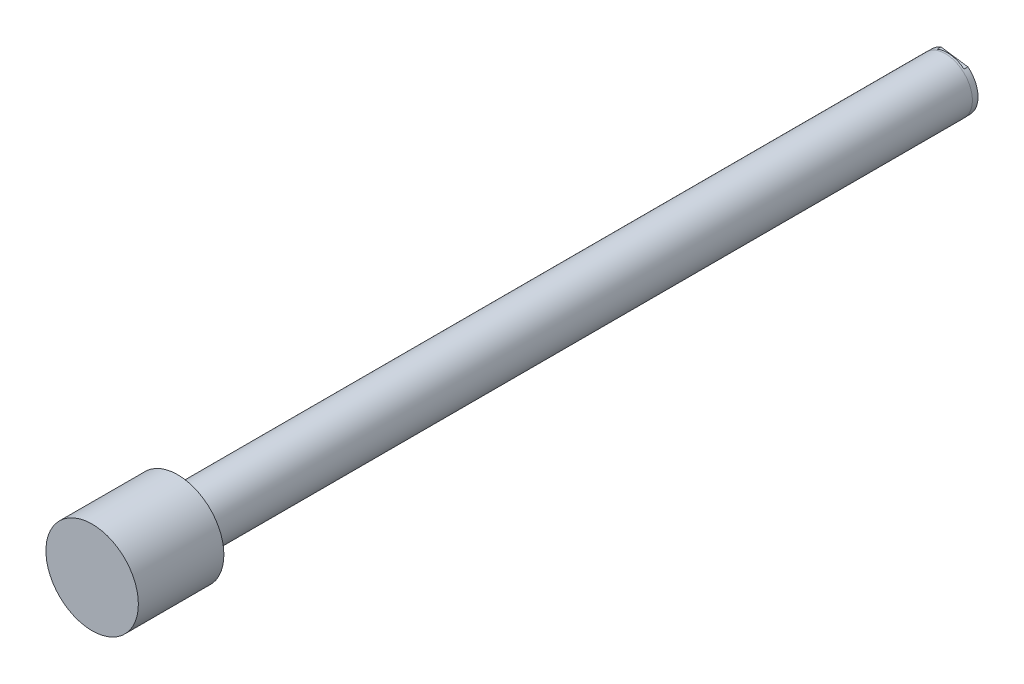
ISO-10303-21;
HEADER;
FILE_DESCRIPTION(('STEP AP214'),'2;1');
FILE_NAME('part.step','',(''),(''),'','','');
FILE_SCHEMA(('AUTOMOTIVE_DESIGN { 1 0 10303 214 1 1 1 1 }'));
ENDSEC;
DATA;
#1=APPLICATION_CONTEXT('core data for automotive mechanical design processes');
#2=APPLICATION_PROTOCOL_DEFINITION('international standard','automotive_design',2000,#1);
#3=PRODUCT_CONTEXT('',#1,'mechanical');
#4=PRODUCT('Part','Part','',(#3));
#5=PRODUCT_RELATED_PRODUCT_CATEGORY('part','',(#4));
#6=PRODUCT_DEFINITION_FORMATION('','',#4);
#7=PRODUCT_DEFINITION_CONTEXT('part definition',#1,'design');
#8=PRODUCT_DEFINITION('design','',#6,#7);
#9=PRODUCT_DEFINITION_SHAPE('','',#8);
#10=(LENGTH_UNIT() NAMED_UNIT(*) SI_UNIT(.MILLI.,.METRE.));
#11=(NAMED_UNIT(*) PLANE_ANGLE_UNIT() SI_UNIT($,.RADIAN.));
#12=(NAMED_UNIT(*) SI_UNIT($,.STERADIAN.) SOLID_ANGLE_UNIT());
#13=UNCERTAINTY_MEASURE_WITH_UNIT(LENGTH_MEASURE(1.E-05),#10,'distance_accuracy_value','');
#14=(GEOMETRIC_REPRESENTATION_CONTEXT(3) GLOBAL_UNCERTAINTY_ASSIGNED_CONTEXT((#13)) GLOBAL_UNIT_ASSIGNED_CONTEXT((#10,
#11,#12)) REPRESENTATION_CONTEXT('',''));
#15=CARTESIAN_POINT('',(0.,0.,0.));
#16=DIRECTION('',(0.,0.,1.));
#17=DIRECTION('',(1.,0.,0.));
#18=AXIS2_PLACEMENT_3D('',#15,#16,#17);
#19=CARTESIAN_POINT('',(0.,0.,-629.6581));
#20=DIRECTION('',(0.,0.,-1.));
#21=DIRECTION('',(-0.99026806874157,0.139173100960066,0.));
#22=AXIS2_PLACEMENT_3D('',#19,#20,#21);
#23=CONICAL_SURFACE('',#22,8.73125,1.02974425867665);
#24=CARTESIAN_POINT('',(0.,0.,-624.411835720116));
#25=VERTEX_POINT('',#24);
#26=VERTEX_LOOP('',#25);
#27=FACE_BOUND('',#26,.T.);
#28=CARTESIAN_POINT('',(0.,0.,-629.6581));
#29=DIRECTION('',(0.,0.,-1.));
#30=DIRECTION('',(-0.99026806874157,0.139173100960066,0.));
#31=AXIS2_PLACEMENT_3D('',#28,#29,#30);
#32=CIRCLE('',#31,8.73125);
#33=CARTESIAN_POINT('',(-8.64627807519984,1.21515513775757,-629.6581));
#34=VERTEX_POINT('',#33);
#35=EDGE_CURVE('E93',#34,#34,#32,.T.);
#36=ORIENTED_EDGE('',*,*,#35,.T.);
#37=EDGE_LOOP('',(#36));
#38=FACE_BOUND('',#37,.T.);
#39=ADVANCED_FACE('F16',(#27,#38),#23,.F.);
#40=CARTESIAN_POINT('',(0.,0.,-672.5206));
#41=DIRECTION('',(0.,0.,-1.));
#42=DIRECTION('',(-0.99026806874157,0.139173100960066,0.));
#43=AXIS2_PLACEMENT_3D('',#40,#41,#42);
#44=CYLINDRICAL_SURFACE('',#43,8.73125);
#45=ORIENTED_EDGE('',*,*,#35,.F.);
#46=EDGE_LOOP('',(#45));
#47=FACE_BOUND('',#46,.T.);
#48=CARTESIAN_POINT('',(0.,0.,-672.5206));
#49=DIRECTION('',(0.,0.,-1.));
#50=DIRECTION('',(-0.99026806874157,0.139173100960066,0.));
#51=AXIS2_PLACEMENT_3D('',#48,#49,#50);
#52=CIRCLE('',#51,8.73125);
#53=CARTESIAN_POINT('',(-8.64627807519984,1.21515513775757,-672.5206));
#54=VERTEX_POINT('',#53);
#55=EDGE_CURVE('E97',#54,#54,#52,.T.);
#56=ORIENTED_EDGE('',*,*,#55,.T.);
#57=EDGE_LOOP('',(#56));
#58=FACE_BOUND('',#57,.T.);
#59=ADVANCED_FACE('F128',(#47,#58),#44,.F.);
#60=CARTESIAN_POINT('',(0.,0.,-669.3456));
#61=DIRECTION('',(0.,0.,-1.));
#62=DIRECTION('',(-0.99026806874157,0.139173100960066,0.));
#63=AXIS2_PLACEMENT_3D('',#60,#61,#62);
#64=PLANE('',#63);
#65=CARTESIAN_POINT('',(0.,0.,-669.3456));
#66=DIRECTION('',(0.,0.,-1.));
#67=DIRECTION('',(-0.99026806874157,0.139173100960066,0.));
#68=AXIS2_PLACEMENT_3D('',#65,#66,#67);
#69=CIRCLE('',#68,22.098);
#70=CARTESIAN_POINT('',(8.43883097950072,-20.4232156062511,-669.3456));
#71=VERTEX_POINT('',#70);
#72=CARTESIAN_POINT('',(-13.7413261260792,-17.3059978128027,-669.3456));
#73=VERTEX_POINT('',#72);
#74=EDGE_CURVE('E65',#71,#73,#69,.T.);
#75=ORIENTED_EDGE('',*,*,#74,.T.);
#76=DIRECTION('',(0.99026806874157,-0.139173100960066,0.));
#77=VECTOR('',#76,1.);
#78=CARTESIAN_POINT('',(8.43883097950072,-20.4232156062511,-669.3456));
#79=LINE('',#78,#77);
#80=EDGE_CURVE('E67',#73,#71,#79,.T.);
#81=ORIENTED_EDGE('',*,*,#80,.T.);
#82=EDGE_LOOP('',(#75,#81));
#83=FACE_BOUND('',#82,.T.);
#84=ADVANCED_FACE('F66',(#83),#64,.T.);
#85=CARTESIAN_POINT('',(0.,0.,-669.3456));
#86=DIRECTION('',(0.,0.,-1.));
#87=DIRECTION('',(-0.99026806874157,0.139173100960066,0.));
#88=AXIS2_PLACEMENT_3D('',#85,#86,#87);
#89=PLANE('',#88);
#90=CARTESIAN_POINT('',(0.,0.,-669.3456));
#91=DIRECTION('',(0.,0.,-1.));
#92=DIRECTION('',(-0.99026806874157,0.139173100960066,0.));
#93=AXIS2_PLACEMENT_3D('',#90,#91,#92);
#94=CIRCLE('',#93,22.098);
#95=CARTESIAN_POINT('',(-8.43883097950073,20.4232156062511,-669.3456));
#96=VERTEX_POINT('',#95);
#97=CARTESIAN_POINT('',(13.7413261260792,17.3059978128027,-669.3456));
#98=VERTEX_POINT('',#97);
#99=EDGE_CURVE('E85',#96,#98,#94,.T.);
#100=ORIENTED_EDGE('',*,*,#99,.T.);
#101=DIRECTION('',(-0.99026806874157,0.139173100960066,0.));
#102=VECTOR('',#101,1.);
#103=CARTESIAN_POINT('',(13.7413261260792,17.3059978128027,-669.3456));
#104=LINE('',#103,#102);
#105=EDGE_CURVE('E87',#98,#96,#104,.T.);
#106=ORIENTED_EDGE('',*,*,#105,.T.);
#107=EDGE_LOOP('',(#100,#106));
#108=FACE_BOUND('',#107,.T.);
#109=ADVANCED_FACE('F118',(#108),#89,.T.);
#110=CARTESIAN_POINT('',(13.7413261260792,17.3059978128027,-669.3456));
#111=DIRECTION('',(-0.139173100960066,-0.99026806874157,0.));
#112=DIRECTION('',(0.,0.,-1.));
#113=AXIS2_PLACEMENT_3D('',#110,#111,#112);
#114=PLANE('',#113);
#115=DIRECTION('',(-0.99026806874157,0.139173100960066,0.));
#116=VECTOR('',#115,1.);
#117=CARTESIAN_POINT('',(13.7413261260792,17.3059978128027,-672.5206));
#118=LINE('',#117,#116);
#119=CARTESIAN_POINT('',(13.7413261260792,17.3059978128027,-672.5206));
#120=VERTEX_POINT('',#119);
#121=CARTESIAN_POINT('',(-8.43883097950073,20.4232156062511,-672.5206));
#122=VERTEX_POINT('',#121);
#123=EDGE_CURVE('E81',#120,#122,#118,.T.);
#124=ORIENTED_EDGE('',*,*,#123,.T.);
#125=DIRECTION('',(0.,0.,-1.));
#126=VECTOR('',#125,1.);
#127=CARTESIAN_POINT('',(-8.43883097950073,20.4232156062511,-669.3456));
#128=LINE('',#127,#126);
#129=EDGE_CURVE('E91',#96,#122,#128,.T.);
#130=ORIENTED_EDGE('',*,*,#129,.F.);
#131=ORIENTED_EDGE('',*,*,#105,.F.);
#132=DIRECTION('',(0.,0.,-1.));
#133=VECTOR('',#132,1.);
#134=CARTESIAN_POINT('',(13.7413261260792,17.3059978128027,-669.3456));
#135=LINE('',#134,#133);
#136=EDGE_CURVE('E41',#98,#120,#135,.T.);
#137=ORIENTED_EDGE('',*,*,#136,.T.);
#138=EDGE_LOOP('',(#124,#130,#131,#137));
#139=FACE_BOUND('',#138,.T.);
#140=ADVANCED_FACE('F115',(#139),#114,.F.);
#141=CARTESIAN_POINT('',(0.,0.,-672.5206));
#142=DIRECTION('',(0.,0.,-1.));
#143=DIRECTION('',(-0.99026806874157,0.139173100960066,0.));
#144=AXIS2_PLACEMENT_3D('',#141,#142,#143);
#145=PLANE('',#144);
#146=DIRECTION('',(0.99026806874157,-0.139173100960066,0.));
#147=VECTOR('',#146,1.);
#148=CARTESIAN_POINT('',(8.43883097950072,-20.4232156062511,-672.5206));
#149=LINE('',#148,#147);
#150=CARTESIAN_POINT('',(-13.7413261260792,-17.3059978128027,-672.5206));
#151=VERTEX_POINT('',#150);
#152=CARTESIAN_POINT('',(8.43883097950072,-20.4232156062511,-672.5206));
#153=VERTEX_POINT('',#152);
#154=EDGE_CURVE('E70',#151,#153,#149,.T.);
#155=ORIENTED_EDGE('',*,*,#154,.F.);
#156=CARTESIAN_POINT('',(0.,0.,-672.5206));
#157=DIRECTION('',(0.,0.,-1.));
#158=DIRECTION('',(-0.99026806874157,0.139173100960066,0.));
#159=AXIS2_PLACEMENT_3D('',#156,#157,#158);
#160=CIRCLE('',#159,22.098);
#161=EDGE_CURVE('E79',#151,#122,#160,.T.);
#162=ORIENTED_EDGE('',*,*,#161,.T.);
#163=ORIENTED_EDGE('',*,*,#123,.F.);
#164=EDGE_CURVE('E25',#120,#153,#160,.T.);
#165=ORIENTED_EDGE('',*,*,#164,.T.);
#166=EDGE_LOOP('',(#155,#162,#163,#165));
#167=FACE_BOUND('',#166,.T.);
#168=ORIENTED_EDGE('',*,*,#55,.F.);
#169=EDGE_LOOP('',(#168));
#170=FACE_BOUND('',#169,.T.);
#171=ADVANCED_FACE('F113',(#167,#170),#145,.T.);
#172=CARTESIAN_POINT('',(8.43883097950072,-20.4232156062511,-669.3456));
#173=DIRECTION('',(0.139173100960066,0.99026806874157,0.));
#174=DIRECTION('',(0.,0.,1.));
#175=AXIS2_PLACEMENT_3D('',#172,#173,#174);
#176=PLANE('',#175);
#177=ORIENTED_EDGE('',*,*,#154,.T.);
#178=DIRECTION('',(0.,0.,-1.));
#179=VECTOR('',#178,1.);
#180=CARTESIAN_POINT('',(8.43883097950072,-20.4232156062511,-669.3456));
#181=LINE('',#180,#179);
#182=EDGE_CURVE('E73',#71,#153,#181,.T.);
#183=ORIENTED_EDGE('',*,*,#182,.F.);
#184=ORIENTED_EDGE('',*,*,#80,.F.);
#185=DIRECTION('',(0.,0.,-1.));
#186=VECTOR('',#185,1.);
#187=CARTESIAN_POINT('',(-13.7413261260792,-17.3059978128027,-669.3456));
#188=LINE('',#187,#186);
#189=EDGE_CURVE('E33',#73,#151,#188,.T.);
#190=ORIENTED_EDGE('',*,*,#189,.T.);
#191=EDGE_LOOP('',(#177,#183,#184,#190));
#192=FACE_BOUND('',#191,.T.);
#193=ADVANCED_FACE('F72',(#192),#176,.F.);
#194=CARTESIAN_POINT('',(0.,0.,-674.856387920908));
#195=DIRECTION('',(0.,0.,-1.));
#196=DIRECTION('',(-0.99026806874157,0.139173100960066,0.));
#197=AXIS2_PLACEMENT_3D('',#194,#195,#196);
#198=CYLINDRICAL_SURFACE('',#197,22.098);
#199=ORIENTED_EDGE('',*,*,#182,.T.);
#200=ORIENTED_EDGE('',*,*,#164,.F.);
#201=ORIENTED_EDGE('',*,*,#136,.F.);
#202=ORIENTED_EDGE('',*,*,#99,.F.);
#203=ORIENTED_EDGE('',*,*,#129,.T.);
#204=ORIENTED_EDGE('',*,*,#161,.F.);
#205=ORIENTED_EDGE('',*,*,#189,.F.);
#206=ORIENTED_EDGE('',*,*,#74,.F.);
#207=EDGE_LOOP('',(#199,#200,#201,#202,#203,#204,#205,#206));
#208=FACE_BOUND('',#207,.T.);
#209=CARTESIAN_POINT('',(0.,0.,-667.7406));
#210=DIRECTION('',(0.,0.,-1.));
#211=DIRECTION('',(-0.99026806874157,0.139173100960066,0.));
#212=AXIS2_PLACEMENT_3D('',#209,#210,#211);
#213=CIRCLE('',#212,22.098);
#214=CARTESIAN_POINT('',(-21.8829437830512,3.07544718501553,-667.7406));
#215=VERTEX_POINT('',#214);
#216=EDGE_CURVE('E10',#215,#215,#213,.T.);
#217=ORIENTED_EDGE('',*,*,#216,.T.);
#218=EDGE_LOOP('',(#217));
#219=FACE_BOUND('',#218,.T.);
#220=ADVANCED_FACE('F76',(#208,#219),#198,.T.);
#221=CARTESIAN_POINT('',(0.,0.,35.56));
#222=DIRECTION('',(0.,0.,1.));
#223=DIRECTION('',(1.,0.,0.));
#224=AXIS2_PLACEMENT_3D('',#221,#222,#223);
#225=PLANE('',#224);
#226=CARTESIAN_POINT('',(0.,0.,35.56));
#227=DIRECTION('',(0.,0.,1.));
#228=DIRECTION('',(1.,0.,0.));
#229=AXIS2_PLACEMENT_3D('',#226,#227,#228);
#230=CIRCLE('',#229,38.1);
#231=CARTESIAN_POINT('',(38.1,0.,35.56));
#232=VERTEX_POINT('',#231);
#233=EDGE_CURVE('E105',#232,#232,#230,.T.);
#234=ORIENTED_EDGE('',*,*,#233,.T.);
#235=EDGE_LOOP('',(#234));
#236=FACE_BOUND('',#235,.T.);
#237=ADVANCED_FACE('F146',(#236),#225,.T.);
#238=CARTESIAN_POINT('',(0.,0.,-34.925));
#239=DIRECTION('',(0.,0.,1.));
#240=DIRECTION('',(1.,0.,0.));
#241=AXIS2_PLACEMENT_3D('',#238,#239,#240);
#242=CYLINDRICAL_SURFACE('',#241,38.1);
#243=ORIENTED_EDGE('',*,*,#233,.F.);
#244=EDGE_LOOP('',(#243));
#245=FACE_BOUND('',#244,.T.);
#246=CARTESIAN_POINT('',(0.,0.,-34.92754));
#247=DIRECTION('',(0.,0.,-1.));
#248=DIRECTION('',(-1.,0.,0.));
#249=AXIS2_PLACEMENT_3D('',#246,#247,#248);
#250=CIRCLE('',#249,38.1);
#251=CARTESIAN_POINT('',(-38.1,0.,-34.92754));
#252=VERTEX_POINT('',#251);
#253=EDGE_CURVE('E102',#252,#252,#250,.T.);
#254=ORIENTED_EDGE('',*,*,#253,.F.);
#255=EDGE_LOOP('',(#254));
#256=FACE_BOUND('',#255,.T.);
#257=ADVANCED_FACE('F150',(#245,#256),#242,.T.);
#258=CARTESIAN_POINT('',(0.,0.,-34.92754));
#259=DIRECTION('',(0.,0.,-1.));
#260=DIRECTION('',(-1.,0.,0.));
#261=AXIS2_PLACEMENT_3D('',#258,#259,#260);
#262=PLANE('',#261);
#263=CARTESIAN_POINT('',(0.,0.,-34.92754));
#264=DIRECTION('',(0.,0.,-1.));
#265=DIRECTION('',(-1.,0.,0.));
#266=AXIS2_PLACEMENT_3D('',#263,#264,#265);
#267=CIRCLE('',#266,22.225);
#268=CARTESIAN_POINT('',(-22.225,0.,-34.92754));
#269=VERTEX_POINT('',#268);
#270=EDGE_CURVE('E20',#269,#269,#267,.T.);
#271=ORIENTED_EDGE('',*,*,#270,.F.);
#272=EDGE_LOOP('',(#271));
#273=FACE_BOUND('',#272,.T.);
#274=ORIENTED_EDGE('',*,*,#253,.T.);
#275=EDGE_LOOP('',(#274));
#276=FACE_BOUND('',#275,.T.);
#277=ADVANCED_FACE('F147',(#273,#276),#262,.T.);
#278=CARTESIAN_POINT('',(0.,0.,-667.7406));
#279=DIRECTION('',(0.,0.,1.));
#280=DIRECTION('',(1.,0.,0.));
#281=AXIS2_PLACEMENT_3D('',#278,#279,#280);
#282=CYLINDRICAL_SURFACE('',#281,22.225);
#283=ORIENTED_EDGE('',*,*,#270,.T.);
#284=EDGE_LOOP('',(#283));
#285=FACE_BOUND('',#284,.T.);
#286=CARTESIAN_POINT('',(0.,0.,-667.7406));
#287=DIRECTION('',(0.,0.,-1.));
#288=DIRECTION('',(-1.,0.,0.));
#289=AXIS2_PLACEMENT_3D('',#286,#287,#288);
#290=CIRCLE('',#289,22.225);
#291=CARTESIAN_POINT('',(-22.225,0.,-667.7406));
#292=VERTEX_POINT('',#291);
#293=EDGE_CURVE('E107',#292,#292,#290,.T.);
#294=ORIENTED_EDGE('',*,*,#293,.F.);
#295=EDGE_LOOP('',(#294));
#296=FACE_BOUND('',#295,.T.);
#297=ADVANCED_FACE('F18',(#285,#296),#282,.T.);
#298=CARTESIAN_POINT('',(0.,0.,-667.7406));
#299=DIRECTION('',(0.,0.,-1.));
#300=DIRECTION('',(-1.,0.,0.));
#301=AXIS2_PLACEMENT_3D('',#298,#299,#300);
#302=PLANE('',#301);
#303=ORIENTED_EDGE('',*,*,#216,.F.);
#304=EDGE_LOOP('',(#303));
#305=FACE_BOUND('',#304,.T.);
#306=ORIENTED_EDGE('',*,*,#293,.T.);
#307=EDGE_LOOP('',(#306));
#308=FACE_BOUND('',#307,.T.);
#309=ADVANCED_FACE('F152',(#305,#308),#302,.T.);
#310=CLOSED_SHELL('',(#39,#59,#84,#109,#140,#171,#193,#220,#237,#257,#277,#297,#309));
#311=MANIFOLD_SOLID_BREP('B1',#310);
#312=ADVANCED_BREP_SHAPE_REPRESENTATION('',(#18,#311),#14);
#313=SHAPE_DEFINITION_REPRESENTATION(#9,#312);
ENDSEC;
END-ISO-10303-21;
